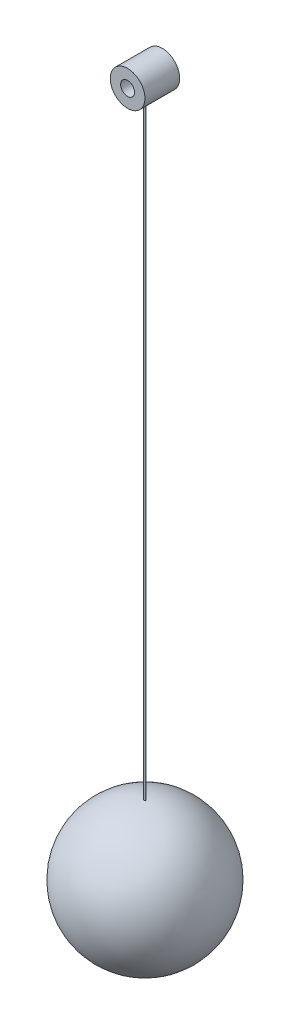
from build123d import *

# Parameters (mm, degrees)
SKETCH2_W           = 0.125
SKETCH2_H           = 100
EXTRUDE1_DEPTH      = 2.5
EXTRUDE1_DEPTH_BACK = 2.5
SKETCH3_R           = 2.5
SKETCH4_R           = 1
CUT_EXTRUDE1_DEPTH  = 104.742469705


with BuildPart() as part:
    # Sketch1 → Revolve1 (revolve)
    with BuildSketch(Plane.XY):
        with BuildLine():
            Line((0, 10), (0, -10))
            ThreePointArc((0, -10), (10, 0), (0, 10))
        make_face()
    revolve(axis=Axis((0, -11, 0), (0, 1, 0)))

    # Sketch2 → Revolve2 (revolve)
    with BuildSketch(Plane(origin=(0, 0, 0), x_dir=(0, 0, -1), z_dir=(1, 0, 0)), mode=Mode.PRIVATE) as revolve2_sk:
        with Locations((0.0625, 50)):
            Rectangle(SKETCH2_W, SKETCH2_H)
    revolve(revolve2_sk.sketch.rotate(Axis((0, 0, 0), (0, 1, 0)), 270), axis=Axis((0, 0, 0), (0, 1, 0)))

    # Sketch3 → Extrude1 (add, two sides: drawn at the far end of the back side and taken through both)
    with BuildSketch(Plane.XY.offset(-EXTRUDE1_DEPTH_BACK)):
        with Locations((0, 100)):
            Circle(SKETCH3_R)
    extrude(amount=EXTRUDE1_DEPTH + EXTRUDE1_DEPTH_BACK)

    # Sketch4 → Cut-Extrude1 (cut, through all)
    with BuildSketch(Plane.XY.offset(2.5)):
        with Locations((0, 100)):
            Circle(SKETCH4_R)
    extrude(amount=-CUT_EXTRUDE1_DEPTH, mode=Mode.SUBTRACT)


solid = part.part
